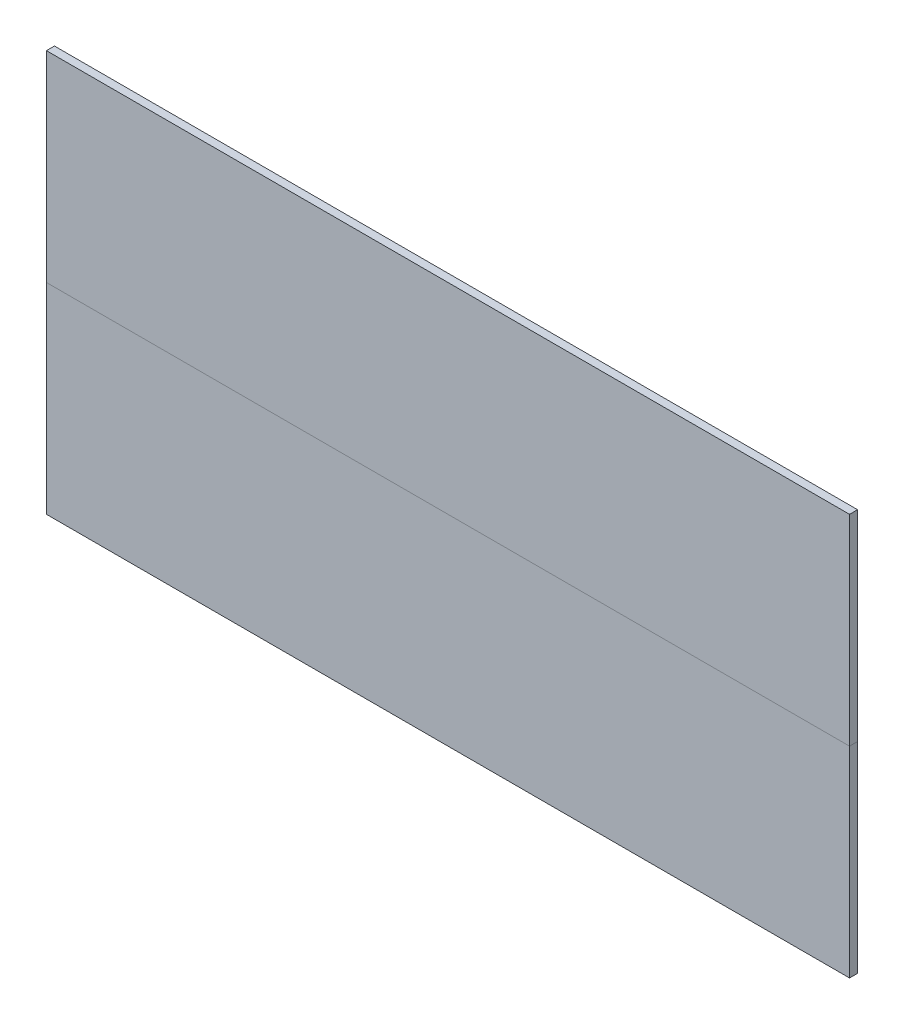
ISO-10303-21;
HEADER;
FILE_DESCRIPTION(('STEP AP214'),'2;1');
FILE_NAME('part.step','',(''),(''),'','','');
FILE_SCHEMA(('AUTOMOTIVE_DESIGN { 1 0 10303 214 1 1 1 1 }'));
ENDSEC;
DATA;
#1=APPLICATION_CONTEXT('core data for automotive mechanical design processes');
#2=APPLICATION_PROTOCOL_DEFINITION('international standard','automotive_design',2000,#1);
#3=PRODUCT_CONTEXT('',#1,'mechanical');
#4=PRODUCT('Part','Part','',(#3));
#5=PRODUCT_RELATED_PRODUCT_CATEGORY('part','',(#4));
#6=PRODUCT_DEFINITION_FORMATION('','',#4);
#7=PRODUCT_DEFINITION_CONTEXT('part definition',#1,'design');
#8=PRODUCT_DEFINITION('design','',#6,#7);
#9=PRODUCT_DEFINITION_SHAPE('','',#8);
#10=(LENGTH_UNIT() NAMED_UNIT(*) SI_UNIT(.MILLI.,.METRE.));
#11=(NAMED_UNIT(*) PLANE_ANGLE_UNIT() SI_UNIT($,.RADIAN.));
#12=(NAMED_UNIT(*) SI_UNIT($,.STERADIAN.) SOLID_ANGLE_UNIT());
#13=UNCERTAINTY_MEASURE_WITH_UNIT(LENGTH_MEASURE(1.E-05),#10,'distance_accuracy_value','');
#14=(GEOMETRIC_REPRESENTATION_CONTEXT(3) GLOBAL_UNCERTAINTY_ASSIGNED_CONTEXT((#13)) GLOBAL_UNIT_ASSIGNED_CONTEXT((#10,
#11,#12)) REPRESENTATION_CONTEXT('',''));
#15=CARTESIAN_POINT('',(0.,0.,0.));
#16=DIRECTION('',(0.,0.,1.));
#17=DIRECTION('',(1.,0.,0.));
#18=AXIS2_PLACEMENT_3D('',#15,#16,#17);
#19=CARTESIAN_POINT('',(0.,25.,0.));
#20=DIRECTION('',(0.,1.,0.));
#21=DIRECTION('',(0.,0.,1.));
#22=AXIS2_PLACEMENT_3D('',#19,#20,#21);
#23=PLANE('',#22);
#24=DIRECTION('',(0.,0.,1.));
#25=VECTOR('',#24,1.);
#26=CARTESIAN_POINT('',(0.,25.,1.));
#27=LINE('',#26,#25);
#28=CARTESIAN_POINT('',(0.,25.,0.));
#29=VERTEX_POINT('',#28);
#30=CARTESIAN_POINT('',(0.,25.,1.));
#31=VERTEX_POINT('',#30);
#32=EDGE_CURVE('E98',#29,#31,#27,.T.);
#33=ORIENTED_EDGE('',*,*,#32,.T.);
#34=DIRECTION('',(1.,0.,0.));
#35=VECTOR('',#34,1.);
#36=CARTESIAN_POINT('',(0.,25.,1.));
#37=LINE('',#36,#35);
#38=CARTESIAN_POINT('',(100.,25.,1.));
#39=VERTEX_POINT('',#38);
#40=EDGE_CURVE('E105',#31,#39,#37,.T.);
#41=ORIENTED_EDGE('',*,*,#40,.T.);
#42=DIRECTION('',(0.,0.,-1.));
#43=VECTOR('',#42,1.);
#44=CARTESIAN_POINT('',(100.,25.,1.));
#45=LINE('',#44,#43);
#46=CARTESIAN_POINT('',(100.,25.,0.));
#47=VERTEX_POINT('',#46);
#48=EDGE_CURVE('E106',#39,#47,#45,.T.);
#49=ORIENTED_EDGE('',*,*,#48,.T.);
#50=DIRECTION('',(1.,0.,0.));
#51=VECTOR('',#50,1.);
#52=CARTESIAN_POINT('',(0.,25.,0.));
#53=LINE('',#52,#51);
#54=EDGE_CURVE('E89',#29,#47,#53,.T.);
#55=ORIENTED_EDGE('',*,*,#54,.F.);
#56=EDGE_LOOP('',(#33,#41,#49,#55));
#57=FACE_BOUND('',#56,.T.);
#58=ADVANCED_FACE('F54',(#57),#23,.T.);
#59=CARTESIAN_POINT('',(0.,0.,1.));
#60=DIRECTION('',(0.,1.,0.));
#61=DIRECTION('',(0.,0.,1.));
#62=AXIS2_PLACEMENT_3D('',#59,#60,#61);
#63=PLANE('',#62);
#64=DIRECTION('',(1.,0.,0.));
#65=VECTOR('',#64,1.);
#66=CARTESIAN_POINT('',(0.,0.,0.));
#67=LINE('',#66,#65);
#68=CARTESIAN_POINT('',(0.,0.,0.));
#69=VERTEX_POINT('',#68);
#70=CARTESIAN_POINT('',(100.,0.,0.));
#71=VERTEX_POINT('',#70);
#72=EDGE_CURVE('E63',#69,#71,#67,.T.);
#73=ORIENTED_EDGE('',*,*,#72,.T.);
#74=DIRECTION('',(0.,0.,-1.));
#75=VECTOR('',#74,1.);
#76=CARTESIAN_POINT('',(100.,0.,1.));
#77=LINE('',#76,#75);
#78=CARTESIAN_POINT('',(100.,0.,1.));
#79=VERTEX_POINT('',#78);
#80=EDGE_CURVE('E117',#79,#71,#77,.T.);
#81=ORIENTED_EDGE('',*,*,#80,.F.);
#82=DIRECTION('',(1.,0.,0.));
#83=VECTOR('',#82,1.);
#84=CARTESIAN_POINT('',(0.,0.,1.));
#85=LINE('',#84,#83);
#86=CARTESIAN_POINT('',(0.,0.,1.));
#87=VERTEX_POINT('',#86);
#88=EDGE_CURVE('E81',#87,#79,#85,.T.);
#89=ORIENTED_EDGE('',*,*,#88,.F.);
#90=DIRECTION('',(0.,0.,-1.));
#91=VECTOR('',#90,1.);
#92=CARTESIAN_POINT('',(0.,0.,1.));
#93=LINE('',#92,#91);
#94=EDGE_CURVE('E100',#87,#69,#93,.T.);
#95=ORIENTED_EDGE('',*,*,#94,.T.);
#96=EDGE_LOOP('',(#73,#81,#89,#95));
#97=FACE_BOUND('',#96,.T.);
#98=ADVANCED_FACE('F136',(#97),#63,.F.);
#99=CARTESIAN_POINT('',(100.,0.,1.));
#100=DIRECTION('',(-1.,0.,0.));
#101=DIRECTION('',(0.,0.,1.));
#102=AXIS2_PLACEMENT_3D('',#99,#100,#101);
#103=PLANE('',#102);
#104=ORIENTED_EDGE('',*,*,#48,.F.);
#105=DIRECTION('',(0.,1.,0.));
#106=VECTOR('',#105,1.);
#107=CARTESIAN_POINT('',(100.,0.,1.));
#108=LINE('',#107,#106);
#109=EDGE_CURVE('E110',#79,#39,#108,.T.);
#110=ORIENTED_EDGE('',*,*,#109,.F.);
#111=ORIENTED_EDGE('',*,*,#80,.T.);
#112=DIRECTION('',(0.,1.,0.));
#113=VECTOR('',#112,1.);
#114=CARTESIAN_POINT('',(100.,0.,0.));
#115=LINE('',#114,#113);
#116=EDGE_CURVE('E102',#71,#47,#115,.T.);
#117=ORIENTED_EDGE('',*,*,#116,.T.);
#118=EDGE_LOOP('',(#104,#110,#111,#117));
#119=FACE_BOUND('',#118,.T.);
#120=ADVANCED_FACE('F129',(#119),#103,.F.);
#121=CARTESIAN_POINT('',(0.,0.,1.));
#122=DIRECTION('',(1.,0.,0.));
#123=DIRECTION('',(0.,0.,-1.));
#124=AXIS2_PLACEMENT_3D('',#121,#122,#123);
#125=PLANE('',#124);
#126=ORIENTED_EDGE('',*,*,#32,.F.);
#127=DIRECTION('',(0.,-1.,0.));
#128=VECTOR('',#127,1.);
#129=CARTESIAN_POINT('',(0.,0.,0.));
#130=LINE('',#129,#128);
#131=EDGE_CURVE('E12',#29,#69,#130,.T.);
#132=ORIENTED_EDGE('',*,*,#131,.T.);
#133=ORIENTED_EDGE('',*,*,#94,.F.);
#134=DIRECTION('',(0.,-1.,0.));
#135=VECTOR('',#134,1.);
#136=CARTESIAN_POINT('',(0.,0.,1.));
#137=LINE('',#136,#135);
#138=EDGE_CURVE('E96',#31,#87,#137,.T.);
#139=ORIENTED_EDGE('',*,*,#138,.F.);
#140=EDGE_LOOP('',(#126,#132,#133,#139));
#141=FACE_BOUND('',#140,.T.);
#142=ADVANCED_FACE('F97',(#141),#125,.F.);
#143=CARTESIAN_POINT('',(0.,0.,0.));
#144=DIRECTION('',(0.,0.,-1.));
#145=DIRECTION('',(-1.,0.,0.));
#146=AXIS2_PLACEMENT_3D('',#143,#144,#145);
#147=PLANE('',#146);
#148=ORIENTED_EDGE('',*,*,#131,.F.);
#149=ORIENTED_EDGE('',*,*,#54,.T.);
#150=ORIENTED_EDGE('',*,*,#116,.F.);
#151=ORIENTED_EDGE('',*,*,#72,.F.);
#152=EDGE_LOOP('',(#148,#149,#150,#151));
#153=FACE_BOUND('',#152,.T.);
#154=ADVANCED_FACE('F56',(#153),#147,.T.);
#155=CARTESIAN_POINT('',(0.,0.,1.));
#156=DIRECTION('',(0.,0.,-1.));
#157=DIRECTION('',(-1.,0.,0.));
#158=AXIS2_PLACEMENT_3D('',#155,#156,#157);
#159=PLANE('',#158);
#160=ORIENTED_EDGE('',*,*,#40,.F.);
#161=ORIENTED_EDGE('',*,*,#138,.T.);
#162=ORIENTED_EDGE('',*,*,#88,.T.);
#163=ORIENTED_EDGE('',*,*,#109,.T.);
#164=EDGE_LOOP('',(#160,#161,#162,#163));
#165=FACE_BOUND('',#164,.T.);
#166=ADVANCED_FACE('F108',(#165),#159,.F.);
#167=CLOSED_SHELL('',(#58,#98,#120,#142,#154,#166));
#168=MANIFOLD_SOLID_BREP('B2',#167);
#169=CARTESIAN_POINT('',(0.,25.,0.));
#170=DIRECTION('',(0.,1.,0.));
#171=DIRECTION('',(0.,0.,1.));
#172=AXIS2_PLACEMENT_3D('',#169,#170,#171);
#173=PLANE('',#172);
#174=DIRECTION('',(0.,0.,1.));
#175=VECTOR('',#174,1.);
#176=CARTESIAN_POINT('',(0.,25.,1.));
#177=LINE('',#176,#175);
#178=CARTESIAN_POINT('',(0.,25.,0.));
#179=VERTEX_POINT('',#178);
#180=CARTESIAN_POINT('',(0.,25.,1.));
#181=VERTEX_POINT('',#180);
#182=EDGE_CURVE('E194',#179,#181,#177,.T.);
#183=ORIENTED_EDGE('',*,*,#182,.F.);
#184=DIRECTION('',(1.,0.,0.));
#185=VECTOR('',#184,1.);
#186=CARTESIAN_POINT('',(0.,25.,0.));
#187=LINE('',#186,#185);
#188=CARTESIAN_POINT('',(100.,25.,0.));
#189=VERTEX_POINT('',#188);
#190=EDGE_CURVE('E52',#179,#189,#187,.T.);
#191=ORIENTED_EDGE('',*,*,#190,.T.);
#192=DIRECTION('',(0.,0.,-1.));
#193=VECTOR('',#192,1.);
#194=CARTESIAN_POINT('',(100.,25.,1.));
#195=LINE('',#194,#193);
#196=CARTESIAN_POINT('',(100.,25.,1.));
#197=VERTEX_POINT('',#196);
#198=EDGE_CURVE('E208',#197,#189,#195,.T.);
#199=ORIENTED_EDGE('',*,*,#198,.F.);
#200=DIRECTION('',(1.,0.,0.));
#201=VECTOR('',#200,1.);
#202=CARTESIAN_POINT('',(0.,25.,1.));
#203=LINE('',#202,#201);
#204=EDGE_CURVE('E187',#181,#197,#203,.T.);
#205=ORIENTED_EDGE('',*,*,#204,.F.);
#206=EDGE_LOOP('',(#183,#191,#199,#205));
#207=FACE_BOUND('',#206,.T.);
#208=ADVANCED_FACE('F184',(#207),#173,.F.);
#209=CARTESIAN_POINT('',(0.,0.,1.));
#210=DIRECTION('',(1.,0.,0.));
#211=DIRECTION('',(0.,0.,-1.));
#212=AXIS2_PLACEMENT_3D('',#209,#210,#211);
#213=PLANE('',#212);
#214=DIRECTION('',(0.,-1.,0.));
#215=VECTOR('',#214,1.);
#216=CARTESIAN_POINT('',(0.,0.,0.));
#217=LINE('',#216,#215);
#218=CARTESIAN_POINT('',(0.,50.,0.));
#219=VERTEX_POINT('',#218);
#220=EDGE_CURVE('E251',#219,#179,#217,.T.);
#221=ORIENTED_EDGE('',*,*,#220,.T.);
#222=ORIENTED_EDGE('',*,*,#182,.T.);
#223=DIRECTION('',(0.,-1.,0.));
#224=VECTOR('',#223,1.);
#225=CARTESIAN_POINT('',(0.,0.,1.));
#226=LINE('',#225,#224);
#227=CARTESIAN_POINT('',(0.,50.,1.));
#228=VERTEX_POINT('',#227);
#229=EDGE_CURVE('E234',#228,#181,#226,.T.);
#230=ORIENTED_EDGE('',*,*,#229,.F.);
#231=DIRECTION('',(0.,0.,-1.));
#232=VECTOR('',#231,1.);
#233=CARTESIAN_POINT('',(0.,50.,1.));
#234=LINE('',#233,#232);
#235=EDGE_CURVE('E241',#228,#219,#234,.T.);
#236=ORIENTED_EDGE('',*,*,#235,.T.);
#237=EDGE_LOOP('',(#221,#222,#230,#236));
#238=FACE_BOUND('',#237,.T.);
#239=ADVANCED_FACE('F263',(#238),#213,.F.);
#240=CARTESIAN_POINT('',(100.,0.,1.));
#241=DIRECTION('',(-1.,0.,0.));
#242=DIRECTION('',(0.,0.,1.));
#243=AXIS2_PLACEMENT_3D('',#240,#241,#242);
#244=PLANE('',#243);
#245=DIRECTION('',(0.,1.,0.));
#246=VECTOR('',#245,1.);
#247=CARTESIAN_POINT('',(100.,0.,1.));
#248=LINE('',#247,#246);
#249=CARTESIAN_POINT('',(100.,50.,1.));
#250=VERTEX_POINT('',#249);
#251=EDGE_CURVE('E226',#197,#250,#248,.T.);
#252=ORIENTED_EDGE('',*,*,#251,.F.);
#253=ORIENTED_EDGE('',*,*,#198,.T.);
#254=DIRECTION('',(0.,1.,0.));
#255=VECTOR('',#254,1.);
#256=CARTESIAN_POINT('',(100.,0.,0.));
#257=LINE('',#256,#255);
#258=CARTESIAN_POINT('',(100.,50.,0.));
#259=VERTEX_POINT('',#258);
#260=EDGE_CURVE('E238',#189,#259,#257,.T.);
#261=ORIENTED_EDGE('',*,*,#260,.T.);
#262=DIRECTION('',(0.,0.,-1.));
#263=VECTOR('',#262,1.);
#264=CARTESIAN_POINT('',(100.,50.,1.));
#265=LINE('',#264,#263);
#266=EDGE_CURVE('E236',#250,#259,#265,.T.);
#267=ORIENTED_EDGE('',*,*,#266,.F.);
#268=EDGE_LOOP('',(#252,#253,#261,#267));
#269=FACE_BOUND('',#268,.T.);
#270=ADVANCED_FACE('F237',(#269),#244,.F.);
#271=CARTESIAN_POINT('',(0.,50.,1.));
#272=DIRECTION('',(0.,-1.,0.));
#273=DIRECTION('',(0.,0.,-1.));
#274=AXIS2_PLACEMENT_3D('',#271,#272,#273);
#275=PLANE('',#274);
#276=DIRECTION('',(-1.,0.,0.));
#277=VECTOR('',#276,1.);
#278=CARTESIAN_POINT('',(0.,50.,0.));
#279=LINE('',#278,#277);
#280=EDGE_CURVE('E256',#259,#219,#279,.T.);
#281=ORIENTED_EDGE('',*,*,#280,.T.);
#282=ORIENTED_EDGE('',*,*,#235,.F.);
#283=DIRECTION('',(-1.,0.,0.));
#284=VECTOR('',#283,1.);
#285=CARTESIAN_POINT('',(0.,50.,1.));
#286=LINE('',#285,#284);
#287=EDGE_CURVE('E231',#250,#228,#286,.T.);
#288=ORIENTED_EDGE('',*,*,#287,.F.);
#289=ORIENTED_EDGE('',*,*,#266,.T.);
#290=EDGE_LOOP('',(#281,#282,#288,#289));
#291=FACE_BOUND('',#290,.T.);
#292=ADVANCED_FACE('F243',(#291),#275,.F.);
#293=CARTESIAN_POINT('',(0.,0.,1.));
#294=DIRECTION('',(0.,0.,-1.));
#295=DIRECTION('',(-1.,0.,0.));
#296=AXIS2_PLACEMENT_3D('',#293,#294,#295);
#297=PLANE('',#296);
#298=ORIENTED_EDGE('',*,*,#229,.T.);
#299=ORIENTED_EDGE('',*,*,#204,.T.);
#300=ORIENTED_EDGE('',*,*,#251,.T.);
#301=ORIENTED_EDGE('',*,*,#287,.T.);
#302=EDGE_LOOP('',(#298,#299,#300,#301));
#303=FACE_BOUND('',#302,.T.);
#304=ADVANCED_FACE('F229',(#303),#297,.F.);
#305=CARTESIAN_POINT('',(0.,0.,0.));
#306=DIRECTION('',(0.,0.,-1.));
#307=DIRECTION('',(-1.,0.,0.));
#308=AXIS2_PLACEMENT_3D('',#305,#306,#307);
#309=PLANE('',#308);
#310=ORIENTED_EDGE('',*,*,#190,.F.);
#311=ORIENTED_EDGE('',*,*,#220,.F.);
#312=ORIENTED_EDGE('',*,*,#280,.F.);
#313=ORIENTED_EDGE('',*,*,#260,.F.);
#314=EDGE_LOOP('',(#310,#311,#312,#313));
#315=FACE_BOUND('',#314,.T.);
#316=ADVANCED_FACE('F267',(#315),#309,.T.);
#317=CLOSED_SHELL('',(#208,#239,#270,#292,#304,#316));
#318=MANIFOLD_SOLID_BREP('B6',#317);
#319=ADVANCED_BREP_SHAPE_REPRESENTATION('',(#18,#168,#318),#14);
#320=SHAPE_DEFINITION_REPRESENTATION(#9,#319);
ENDSEC;
END-ISO-10303-21;
